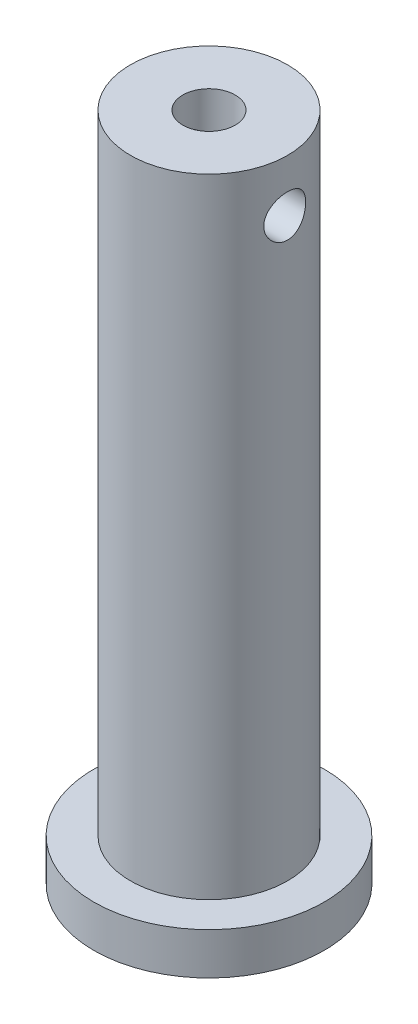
ISO-10303-21;
HEADER;
FILE_DESCRIPTION(('STEP AP214'),'2;1');
FILE_NAME('part.step','',(''),(''),'','','');
FILE_SCHEMA(('AUTOMOTIVE_DESIGN { 1 0 10303 214 1 1 1 1 }'));
ENDSEC;
DATA;
#1=APPLICATION_CONTEXT('core data for automotive mechanical design processes');
#2=APPLICATION_PROTOCOL_DEFINITION('international standard','automotive_design',2000,#1);
#3=PRODUCT_CONTEXT('',#1,'mechanical');
#4=PRODUCT('Part','Part','',(#3));
#5=PRODUCT_RELATED_PRODUCT_CATEGORY('part','',(#4));
#6=PRODUCT_DEFINITION_FORMATION('','',#4);
#7=PRODUCT_DEFINITION_CONTEXT('part definition',#1,'design');
#8=PRODUCT_DEFINITION('design','',#6,#7);
#9=PRODUCT_DEFINITION_SHAPE('','',#8);
#10=(LENGTH_UNIT() NAMED_UNIT(*) SI_UNIT(.MILLI.,.METRE.));
#11=(NAMED_UNIT(*) PLANE_ANGLE_UNIT() SI_UNIT($,.RADIAN.));
#12=(NAMED_UNIT(*) SI_UNIT($,.STERADIAN.) SOLID_ANGLE_UNIT());
#13=UNCERTAINTY_MEASURE_WITH_UNIT(LENGTH_MEASURE(1.E-05),#10,'distance_accuracy_value','');
#14=(GEOMETRIC_REPRESENTATION_CONTEXT(3) GLOBAL_UNCERTAINTY_ASSIGNED_CONTEXT((#13)) GLOBAL_UNIT_ASSIGNED_CONTEXT((#10,
#11,#12)) REPRESENTATION_CONTEXT('',''));
#15=CARTESIAN_POINT('',(0.,0.,0.));
#16=DIRECTION('',(0.,0.,1.));
#17=DIRECTION('',(1.,0.,0.));
#18=AXIS2_PLACEMENT_3D('',#15,#16,#17);
#19=CARTESIAN_POINT('',(0.,0.,0.));
#20=DIRECTION('',(0.,-1.,0.));
#21=DIRECTION('',(0.,0.,-1.));
#22=AXIS2_PLACEMENT_3D('',#19,#20,#21);
#23=PLANE('',#22);
#24=CARTESIAN_POINT('',(0.,0.,0.));
#25=DIRECTION('',(0.,-1.,0.));
#26=DIRECTION('',(0.,0.,-1.));
#27=AXIS2_PLACEMENT_3D('',#24,#25,#26);
#28=CIRCLE('',#27,5.5);
#29=CARTESIAN_POINT('',(0.,0.,-5.5));
#30=VERTEX_POINT('',#29);
#31=EDGE_CURVE('E11',#30,#30,#28,.T.);
#32=ORIENTED_EDGE('',*,*,#31,.T.);
#33=EDGE_LOOP('',(#32));
#34=FACE_BOUND('',#33,.T.);
#35=ADVANCED_FACE('F29',(#34),#23,.T.);
#36=CARTESIAN_POINT('',(0.,-9.92791878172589,0.));
#37=DIRECTION('',(0.,-1.,0.));
#38=DIRECTION('',(0.,0.,-1.));
#39=AXIS2_PLACEMENT_3D('',#36,#37,#38);
#40=CYLINDRICAL_SURFACE('',#39,5.5);
#41=CARTESIAN_POINT('',(0.,2.,0.));
#42=DIRECTION('',(0.,-1.,0.));
#43=DIRECTION('',(0.,0.,-1.));
#44=AXIS2_PLACEMENT_3D('',#41,#42,#43);
#45=CIRCLE('',#44,5.5);
#46=CARTESIAN_POINT('',(0.,2.,-5.5));
#47=VERTEX_POINT('',#46);
#48=EDGE_CURVE('E40',#47,#47,#45,.T.);
#49=ORIENTED_EDGE('',*,*,#48,.T.);
#50=EDGE_LOOP('',(#49));
#51=FACE_BOUND('',#50,.T.);
#52=ORIENTED_EDGE('',*,*,#31,.F.);
#53=EDGE_LOOP('',(#52));
#54=FACE_BOUND('',#53,.T.);
#55=ADVANCED_FACE('F98',(#51,#54),#40,.T.);
#56=CARTESIAN_POINT('',(5.5,2.,0.));
#57=DIRECTION('',(0.,1.,0.));
#58=DIRECTION('',(0.,0.,1.));
#59=AXIS2_PLACEMENT_3D('',#56,#57,#58);
#60=PLANE('',#59);
#61=CARTESIAN_POINT('',(0.,2.,0.));
#62=DIRECTION('',(0.,-1.,0.));
#63=DIRECTION('',(0.,0.,-1.));
#64=AXIS2_PLACEMENT_3D('',#61,#62,#63);
#65=CIRCLE('',#64,3.75);
#66=CARTESIAN_POINT('',(0.,2.,-3.75));
#67=VERTEX_POINT('',#66);
#68=EDGE_CURVE('E58',#67,#67,#65,.T.);
#69=ORIENTED_EDGE('',*,*,#68,.T.);
#70=EDGE_LOOP('',(#69));
#71=FACE_BOUND('',#70,.T.);
#72=ORIENTED_EDGE('',*,*,#48,.F.);
#73=EDGE_LOOP('',(#72));
#74=FACE_BOUND('',#73,.T.);
#75=ADVANCED_FACE('F94',(#71,#74),#60,.T.);
#76=CARTESIAN_POINT('',(0.,-9.92791878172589,0.));
#77=DIRECTION('',(0.,-1.,0.));
#78=DIRECTION('',(0.,0.,-1.));
#79=AXIS2_PLACEMENT_3D('',#76,#77,#78);
#80=CYLINDRICAL_SURFACE('',#79,3.75);
#81=CARTESIAN_POINT('',(-3.61420807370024,29.5,-1.));
#82=CARTESIAN_POINT('',(-3.61420902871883,29.4449120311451,-0.999998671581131));
#83=CARTESIAN_POINT('',(-3.61548132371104,29.389809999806,-0.995432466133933));
#84=CARTESIAN_POINT('',(-3.62041780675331,29.2811972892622,-0.977322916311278));
#85=CARTESIAN_POINT('',(-3.62408319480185,29.227687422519,-0.963775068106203));
#86=CARTESIAN_POINT('',(-3.63336187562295,29.1238459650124,-0.928179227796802));
#87=CARTESIAN_POINT('',(-3.63897242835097,29.073510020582,-0.906143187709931));
#88=CARTESIAN_POINT('',(-3.65150577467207,28.9772416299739,-0.854233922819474));
#89=CARTESIAN_POINT('',(-3.65842867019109,28.9313095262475,-0.824360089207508));
#90=CARTESIAN_POINT('',(-3.67300069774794,28.8440037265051,-0.756824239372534));
#91=CARTESIAN_POINT('',(-3.68066270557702,28.8027564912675,-0.719001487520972));
#92=CARTESIAN_POINT('',(-3.69573850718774,28.7271092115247,-0.636987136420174));
#93=CARTESIAN_POINT('',(-3.7031522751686,28.6927098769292,-0.592794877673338));
#94=CARTESIAN_POINT('',(-3.71703994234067,28.6312075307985,-0.498419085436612));
#95=CARTESIAN_POINT('',(-3.72349688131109,28.6042302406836,-0.448150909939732));
#96=CARTESIAN_POINT('',(-3.73459563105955,28.5591576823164,-0.34359152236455));
#97=CARTESIAN_POINT('',(-3.73923774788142,28.5410609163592,-0.289300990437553));
#98=CARTESIAN_POINT('',(-3.74609276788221,28.5146723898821,-0.179557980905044));
#99=CARTESIAN_POINT('',(-3.7483588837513,28.506165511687,-0.124160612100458));
#100=CARTESIAN_POINT('',(-3.75039262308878,28.4985214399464,-0.0126817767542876));
#101=CARTESIAN_POINT('',(-3.75016066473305,28.4993826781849,0.0433995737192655));
#102=CARTESIAN_POINT('',(-3.74726337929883,28.5102989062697,0.153157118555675));
#103=CARTESIAN_POINT('',(-3.74465957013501,28.5201214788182,0.206858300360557));
#104=CARTESIAN_POINT('',(-3.73738374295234,28.548306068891,0.311820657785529));
#105=CARTESIAN_POINT('',(-3.7327116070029,28.566668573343,0.363081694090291));
#106=CARTESIAN_POINT('',(-3.72173284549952,28.6115899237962,0.462301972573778));
#107=CARTESIAN_POINT('',(-3.71541043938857,28.6382284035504,0.510223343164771));
#108=CARTESIAN_POINT('',(-3.70181234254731,28.6988844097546,0.600994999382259));
#109=CARTESIAN_POINT('',(-3.69453646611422,28.7329033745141,0.643844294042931));
#110=CARTESIAN_POINT('',(-3.6795563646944,28.808588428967,0.724642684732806));
#111=CARTESIAN_POINT('',(-3.67184584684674,28.8504572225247,0.762400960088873));
#112=CARTESIAN_POINT('',(-3.65706702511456,28.9400123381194,0.830406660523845));
#113=CARTESIAN_POINT('',(-3.64999876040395,28.9876990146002,0.860653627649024));
#114=CARTESIAN_POINT('',(-3.63727951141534,29.0879500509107,0.912923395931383));
#115=CARTESIAN_POINT('',(-3.63163753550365,29.1405426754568,0.934894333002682));
#116=CARTESIAN_POINT('',(-3.62252162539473,29.2488632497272,0.969620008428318));
#117=CARTESIAN_POINT('',(-3.61904715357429,29.3045904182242,0.982377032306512));
#118=CARTESIAN_POINT('',(-3.61477417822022,29.4158136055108,0.997983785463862));
#119=CARTESIAN_POINT('',(-3.61389881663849,29.4712667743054,1.00111816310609));
#120=CARTESIAN_POINT('',(-3.61471289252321,29.5819048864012,0.998174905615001));
#121=CARTESIAN_POINT('',(-3.61640205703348,29.6370898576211,0.992098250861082));
#122=CARTESIAN_POINT('',(-3.62208062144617,29.7445282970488,0.971156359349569));
#123=CARTESIAN_POINT('',(-3.62602519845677,29.7968177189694,0.956462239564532));
#124=CARTESIAN_POINT('',(-3.63572634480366,29.8981898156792,0.918894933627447));
#125=CARTESIAN_POINT('',(-3.64148315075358,29.9472720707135,0.896020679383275));
#126=CARTESIAN_POINT('',(-3.65431786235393,30.0420274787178,0.842164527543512));
#127=CARTESIAN_POINT('',(-3.66142202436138,30.0876019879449,0.811015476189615));
#128=CARTESIAN_POINT('',(-3.67608920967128,30.1729816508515,0.741701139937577));
#129=CARTESIAN_POINT('',(-3.68365231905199,30.2127857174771,0.703534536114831));
#130=CARTESIAN_POINT('',(-3.69864982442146,30.286676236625,0.619951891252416));
#131=CARTESIAN_POINT('',(-3.70607418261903,30.3205641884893,0.574358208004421));
#132=CARTESIAN_POINT('',(-3.71973335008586,30.3802054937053,0.477964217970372));
#133=CARTESIAN_POINT('',(-3.72596822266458,30.4059592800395,0.427164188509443));
#134=CARTESIAN_POINT('',(-3.73650575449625,30.4483648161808,0.322157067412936));
#135=CARTESIAN_POINT('',(-3.74082279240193,30.4650845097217,0.267978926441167));
#136=CARTESIAN_POINT('',(-3.74710151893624,30.4891443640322,0.157449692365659));
#137=CARTESIAN_POINT('',(-3.74906372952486,30.4964866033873,0.101099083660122));
#138=CARTESIAN_POINT('',(-3.75038706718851,30.5014529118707,-0.010321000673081));
#139=CARTESIAN_POINT('',(-3.74982613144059,30.4993681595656,-0.0653767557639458));
#140=CARTESIAN_POINT('',(-3.74634245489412,30.4862157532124,-0.174324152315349));
#141=CARTESIAN_POINT('',(-3.74341980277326,30.4751484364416,-0.228215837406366));
#142=CARTESIAN_POINT('',(-3.73555655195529,30.4445096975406,-0.332955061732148));
#143=CARTESIAN_POINT('',(-3.73062998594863,30.4249973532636,-0.383821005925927));
#144=CARTESIAN_POINT('',(-3.71927408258,30.3780751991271,-0.481586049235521));
#145=CARTESIAN_POINT('',(-3.71284453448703,30.3506642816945,-0.528484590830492));
#146=CARTESIAN_POINT('',(-3.6989566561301,30.2878708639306,-0.618339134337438));
#147=CARTESIAN_POINT('',(-3.69147546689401,30.2522953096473,-0.661156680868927));
#148=CARTESIAN_POINT('',(-3.67642000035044,30.1745486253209,-0.740312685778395));
#149=CARTESIAN_POINT('',(-3.66884569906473,30.132375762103,-0.776649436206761));
#150=CARTESIAN_POINT('',(-3.65426979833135,30.0415158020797,-0.842603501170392));
#151=CARTESIAN_POINT('',(-3.64728445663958,29.9927058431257,-0.872055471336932));
#152=CARTESIAN_POINT('',(-3.63490697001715,29.8906468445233,-0.922293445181));
#153=CARTESIAN_POINT('',(-3.62951378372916,29.837400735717,-0.943085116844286));
#154=CARTESIAN_POINT('',(-3.62168000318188,29.7369593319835,-0.972690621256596));
#155=CARTESIAN_POINT('',(-3.61890070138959,29.6901993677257,-0.982907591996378));
#156=CARTESIAN_POINT('',(-3.61516442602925,29.595629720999,-0.996562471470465));
#157=CARTESIAN_POINT('',(-3.6142072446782,29.5478201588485,-1.00000115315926));
#158=CARTESIAN_POINT('',(-3.61420807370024,29.5,-1.));
#159=B_SPLINE_CURVE_WITH_KNOTS('',3,(#81,#82,#83,#84,#85,#86,#87,#88,#89,#90,#91,#92,#93,#94,
#95,#96,#97,#98,#99,#100,#101,#102,#103,#104,#105,#106,#107,#108,#109,#110,#111,#112,#113,#114,
#115,#116,#117,#118,#119,#120,#121,#122,#123,#124,#125,#126,#127,#128,#129,#130,#131,#132,#133,
#134,#135,#136,#137,#138,#139,#140,#141,#142,#143,#144,#145,#146,#147,#148,#149,#150,#151,#152,
#153,#154,#155,#156,#157,#158),.UNSPECIFIED.,.T.,.F.,(4,2,2,2,2,2,2,2,2,2,2,2,2,2,2,2,2,2,2,2,2,
2,2,2,2,2,2,2,2,2,2,2,2,2,2,2,2,2,4),(0.,0.165088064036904,0.330258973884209,0.495198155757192,
0.660150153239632,0.828829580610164,0.997526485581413,1.16892603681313,1.34029667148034,
1.50774152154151,1.67515834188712,1.83835285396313,2.00155667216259,2.16638224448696,
2.33123996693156,2.50115881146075,2.671088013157,2.84206507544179,3.01299971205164,
3.17882667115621,3.34463598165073,3.50725925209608,3.66990376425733,3.83612317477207,
4.00237385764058,4.17342953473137,4.34447610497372,4.51421769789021,4.68392165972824,
4.84842027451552,5.01291271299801,5.17627257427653,5.33965535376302,5.50739426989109,
5.67517732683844,5.84665019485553,6.01801066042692,6.16133483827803,6.30464267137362),.UNSPECIFIED.);
#160=CARTESIAN_POINT('',(-3.61420807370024,29.5,-1.));
#161=VERTEX_POINT('',#160);
#162=EDGE_CURVE('E61',#161,#161,#159,.T.);
#163=ORIENTED_EDGE('',*,*,#162,.F.);
#164=EDGE_LOOP('',(#163));
#165=FACE_BOUND('',#164,.T.);
#166=CARTESIAN_POINT('',(3.61420807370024,29.5,-1.));
#167=CARTESIAN_POINT('',(3.61420902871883,29.5550879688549,-0.999998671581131));
#168=CARTESIAN_POINT('',(3.61548132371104,29.610190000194,-0.995432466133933));
#169=CARTESIAN_POINT('',(3.62041780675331,29.7188027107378,-0.977322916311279));
#170=CARTESIAN_POINT('',(3.62408319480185,29.772312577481,-0.963775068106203));
#171=CARTESIAN_POINT('',(3.63336187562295,29.8761540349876,-0.928179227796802));
#172=CARTESIAN_POINT('',(3.63897242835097,29.926489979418,-0.906143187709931));
#173=CARTESIAN_POINT('',(3.65150577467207,30.0227583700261,-0.854233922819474));
#174=CARTESIAN_POINT('',(3.65842867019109,30.0686904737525,-0.824360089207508));
#175=CARTESIAN_POINT('',(3.67300069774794,30.1559962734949,-0.756824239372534));
#176=CARTESIAN_POINT('',(3.68066270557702,30.1972435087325,-0.719001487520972));
#177=CARTESIAN_POINT('',(3.69573850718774,30.2728907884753,-0.636987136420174));
#178=CARTESIAN_POINT('',(3.7031522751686,30.3072901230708,-0.592794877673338));
#179=CARTESIAN_POINT('',(3.71703994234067,30.3687924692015,-0.498419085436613));
#180=CARTESIAN_POINT('',(3.72349688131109,30.3957697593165,-0.448150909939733));
#181=CARTESIAN_POINT('',(3.73459563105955,30.4408423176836,-0.343591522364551));
#182=CARTESIAN_POINT('',(3.73923774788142,30.4589390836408,-0.289300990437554));
#183=CARTESIAN_POINT('',(3.74609276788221,30.4853276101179,-0.179557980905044));
#184=CARTESIAN_POINT('',(3.7483588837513,30.493834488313,-0.124160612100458));
#185=CARTESIAN_POINT('',(3.75039262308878,30.5014785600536,-0.0126817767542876));
#186=CARTESIAN_POINT('',(3.75016066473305,30.5006173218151,0.0433995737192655));
#187=CARTESIAN_POINT('',(3.74726337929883,30.4897010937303,0.153157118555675));
#188=CARTESIAN_POINT('',(3.74465957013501,30.4798785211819,0.206858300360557));
#189=CARTESIAN_POINT('',(3.73738374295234,30.451693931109,0.311820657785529));
#190=CARTESIAN_POINT('',(3.7327116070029,30.433331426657,0.363081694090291));
#191=CARTESIAN_POINT('',(3.72173284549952,30.3884100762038,0.462301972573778));
#192=CARTESIAN_POINT('',(3.71541043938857,30.3617715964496,0.510223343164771));
#193=CARTESIAN_POINT('',(3.70181234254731,30.3011155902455,0.600994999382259));
#194=CARTESIAN_POINT('',(3.69453646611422,30.2670966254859,0.643844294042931));
#195=CARTESIAN_POINT('',(3.6795563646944,30.191411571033,0.724642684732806));
#196=CARTESIAN_POINT('',(3.67184584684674,30.1495427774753,0.762400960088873));
#197=CARTESIAN_POINT('',(3.65706702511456,30.0599876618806,0.830406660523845));
#198=CARTESIAN_POINT('',(3.64999876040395,30.0123009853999,0.860653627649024));
#199=CARTESIAN_POINT('',(3.63727951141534,29.9120499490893,0.912923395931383));
#200=CARTESIAN_POINT('',(3.63163753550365,29.8594573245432,0.934894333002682));
#201=CARTESIAN_POINT('',(3.62252162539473,29.7511367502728,0.969620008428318));
#202=CARTESIAN_POINT('',(3.61904715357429,29.6954095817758,0.982377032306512));
#203=CARTESIAN_POINT('',(3.61477417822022,29.5841863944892,0.997983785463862));
#204=CARTESIAN_POINT('',(3.61389881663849,29.5287332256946,1.00111816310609));
#205=CARTESIAN_POINT('',(3.61471289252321,29.4180951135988,0.998174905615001));
#206=CARTESIAN_POINT('',(3.61640205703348,29.3629101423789,0.992098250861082));
#207=CARTESIAN_POINT('',(3.62208062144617,29.2554717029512,0.971156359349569));
#208=CARTESIAN_POINT('',(3.62602519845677,29.2031822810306,0.956462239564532));
#209=CARTESIAN_POINT('',(3.63572634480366,29.1018101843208,0.918894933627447));
#210=CARTESIAN_POINT('',(3.64148315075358,29.0527279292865,0.896020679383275));
#211=CARTESIAN_POINT('',(3.65431786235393,28.9579725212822,0.842164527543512));
#212=CARTESIAN_POINT('',(3.66142202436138,28.9123980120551,0.811015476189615));
#213=CARTESIAN_POINT('',(3.67608920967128,28.8270183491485,0.741701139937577));
#214=CARTESIAN_POINT('',(3.68365231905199,28.7872142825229,0.703534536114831));
#215=CARTESIAN_POINT('',(3.69864982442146,28.713323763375,0.619951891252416));
#216=CARTESIAN_POINT('',(3.70607418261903,28.6794358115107,0.574358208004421));
#217=CARTESIAN_POINT('',(3.71973335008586,28.6197945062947,0.477964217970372));
#218=CARTESIAN_POINT('',(3.72596822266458,28.5940407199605,0.427164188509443));
#219=CARTESIAN_POINT('',(3.73650575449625,28.5516351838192,0.322157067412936));
#220=CARTESIAN_POINT('',(3.74082279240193,28.5349154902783,0.267978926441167));
#221=CARTESIAN_POINT('',(3.74710151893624,28.5108556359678,0.157449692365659));
#222=CARTESIAN_POINT('',(3.74906372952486,28.5035133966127,0.101099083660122));
#223=CARTESIAN_POINT('',(3.75038706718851,28.4985470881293,-0.010321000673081));
#224=CARTESIAN_POINT('',(3.74982613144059,28.5006318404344,-0.0653767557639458));
#225=CARTESIAN_POINT('',(3.74634245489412,28.5137842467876,-0.174324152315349));
#226=CARTESIAN_POINT('',(3.74341980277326,28.5248515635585,-0.228215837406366));
#227=CARTESIAN_POINT('',(3.73555655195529,28.5554903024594,-0.332955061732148));
#228=CARTESIAN_POINT('',(3.73062998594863,28.5750026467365,-0.383821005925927));
#229=CARTESIAN_POINT('',(3.71927408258,28.6219248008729,-0.481586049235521));
#230=CARTESIAN_POINT('',(3.71284453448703,28.6493357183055,-0.528484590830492));
#231=CARTESIAN_POINT('',(3.6989566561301,28.7121291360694,-0.618339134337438));
#232=CARTESIAN_POINT('',(3.69147546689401,28.7477046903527,-0.661156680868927));
#233=CARTESIAN_POINT('',(3.67642000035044,28.8254513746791,-0.740312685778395));
#234=CARTESIAN_POINT('',(3.66884569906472,28.867624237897,-0.776649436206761));
#235=CARTESIAN_POINT('',(3.65426979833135,28.9584841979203,-0.842603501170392));
#236=CARTESIAN_POINT('',(3.64728445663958,29.0072941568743,-0.872055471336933));
#237=CARTESIAN_POINT('',(3.63490697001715,29.1093531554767,-0.922293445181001));
#238=CARTESIAN_POINT('',(3.62951378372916,29.162599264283,-0.943085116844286));
#239=CARTESIAN_POINT('',(3.62168000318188,29.2630406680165,-0.972690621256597));
#240=CARTESIAN_POINT('',(3.61890070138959,29.3098006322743,-0.98290759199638));
#241=CARTESIAN_POINT('',(3.61516442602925,29.4043702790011,-0.996562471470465));
#242=CARTESIAN_POINT('',(3.6142072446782,29.4521798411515,-1.00000115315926));
#243=CARTESIAN_POINT('',(3.61420807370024,29.5,-1.));
#244=B_SPLINE_CURVE_WITH_KNOTS('',3,(#166,#167,#168,#169,#170,#171,#172,#173,#174,#175,#176,
#177,#178,#179,#180,#181,#182,#183,#184,#185,#186,#187,#188,#189,#190,#191,#192,#193,#194,#195,
#196,#197,#198,#199,#200,#201,#202,#203,#204,#205,#206,#207,#208,#209,#210,#211,#212,#213,#214,
#215,#216,#217,#218,#219,#220,#221,#222,#223,#224,#225,#226,#227,#228,#229,#230,#231,#232,#233,
#234,#235,#236,#237,#238,#239,#240,#241,#242,#243),.UNSPECIFIED.,.T.,.F.,(4,2,2,2,2,2,2,2,2,2,2,
2,2,2,2,2,2,2,2,2,2,2,2,2,2,2,2,2,2,2,2,2,2,2,2,2,2,2,4),(0.,0.165088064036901,
0.330258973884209,0.495198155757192,0.660150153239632,0.828829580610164,0.997526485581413,
1.16892603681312,1.34029667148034,1.50774152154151,1.67515834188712,1.83835285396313,
2.00155667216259,2.16638224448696,2.33123996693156,2.50115881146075,2.671088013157,
2.84206507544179,3.01299971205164,3.17882667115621,3.34463598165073,3.50725925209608,
3.66990376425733,3.83612317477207,4.00237385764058,4.17342953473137,4.34447610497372,
4.51421769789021,4.68392165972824,4.84842027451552,5.01291271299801,5.17627257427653,
5.33965535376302,5.50739426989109,5.67517732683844,5.84665019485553,6.01801066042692,
6.16133483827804,6.30464267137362),.UNSPECIFIED.);
#245=CARTESIAN_POINT('',(3.61420807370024,29.5,-1.));
#246=VERTEX_POINT('',#245);
#247=EDGE_CURVE('E82',#246,#246,#244,.T.);
#248=ORIENTED_EDGE('',*,*,#247,.F.);
#249=EDGE_LOOP('',(#248));
#250=FACE_BOUND('',#249,.T.);
#251=CARTESIAN_POINT('',(0.,32.,0.));
#252=DIRECTION('',(0.,-1.,0.));
#253=DIRECTION('',(0.,0.,-1.));
#254=AXIS2_PLACEMENT_3D('',#251,#252,#253);
#255=CIRCLE('',#254,3.75);
#256=CARTESIAN_POINT('',(0.,32.,-3.75));
#257=VERTEX_POINT('',#256);
#258=EDGE_CURVE('E54',#257,#257,#255,.T.);
#259=ORIENTED_EDGE('',*,*,#258,.T.);
#260=EDGE_LOOP('',(#259));
#261=FACE_BOUND('',#260,.T.);
#262=ORIENTED_EDGE('',*,*,#68,.F.);
#263=EDGE_LOOP('',(#262));
#264=FACE_BOUND('',#263,.T.);
#265=ADVANCED_FACE('F89',(#165,#250,#261,#264),#80,.T.);
#266=CARTESIAN_POINT('',(3.75,32.,0.));
#267=DIRECTION('',(0.,1.,0.));
#268=DIRECTION('',(0.,0.,1.));
#269=AXIS2_PLACEMENT_3D('',#266,#267,#268);
#270=PLANE('',#269);
#271=CARTESIAN_POINT('',(0.,32.,0.));
#272=DIRECTION('',(0.,1.,0.));
#273=DIRECTION('',(0.,0.,1.));
#274=AXIS2_PLACEMENT_3D('',#271,#272,#273);
#275=CIRCLE('',#274,1.25);
#276=CARTESIAN_POINT('',(0.,32.,1.25));
#277=VERTEX_POINT('',#276);
#278=EDGE_CURVE('E55',#277,#277,#275,.T.);
#279=ORIENTED_EDGE('',*,*,#278,.F.);
#280=EDGE_LOOP('',(#279));
#281=FACE_BOUND('',#280,.T.);
#282=ORIENTED_EDGE('',*,*,#258,.F.);
#283=EDGE_LOOP('',(#282));
#284=FACE_BOUND('',#283,.T.);
#285=ADVANCED_FACE('F48',(#281,#284),#270,.T.);
#286=CARTESIAN_POINT('',(0.,14.5,0.));
#287=DIRECTION('',(0.,1.,0.));
#288=DIRECTION('',(0.,0.,1.));
#289=AXIS2_PLACEMENT_3D('',#286,#287,#288);
#290=CONICAL_SURFACE('',#289,1.25,1.02974425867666);
#291=CARTESIAN_POINT('',(0.,13.7489242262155,0.));
#292=VERTEX_POINT('',#291);
#293=VERTEX_LOOP('',#292);
#294=FACE_BOUND('',#293,.T.);
#295=CARTESIAN_POINT('',(0.,14.5,0.));
#296=DIRECTION('',(0.,1.,0.));
#297=DIRECTION('',(0.,0.,1.));
#298=AXIS2_PLACEMENT_3D('',#295,#296,#297);
#299=CIRCLE('',#298,1.25);
#300=CARTESIAN_POINT('',(0.,14.5,1.25));
#301=VERTEX_POINT('',#300);
#302=EDGE_CURVE('E52',#301,#301,#299,.T.);
#303=ORIENTED_EDGE('',*,*,#302,.T.);
#304=EDGE_LOOP('',(#303));
#305=FACE_BOUND('',#304,.T.);
#306=ADVANCED_FACE('F44',(#294,#305),#290,.F.);
#307=CARTESIAN_POINT('',(0.,32.,0.));
#308=DIRECTION('',(0.,1.,0.));
#309=DIRECTION('',(0.,0.,1.));
#310=AXIS2_PLACEMENT_3D('',#307,#308,#309);
#311=CYLINDRICAL_SURFACE('',#310,1.25);
#312=CARTESIAN_POINT('',(-0.749999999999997,29.5,-1.));
#313=CARTESIAN_POINT('',(-0.750011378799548,29.4624594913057,-0.9999949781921));
#314=CARTESIAN_POINT('',(-0.752877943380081,29.4248605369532,-0.997861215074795));
#315=CARTESIAN_POINT('',(-0.763798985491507,29.3508427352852,-0.989521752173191));
#316=CARTESIAN_POINT('',(-0.771871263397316,29.3144283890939,-0.983302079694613));
#317=CARTESIAN_POINT('',(-0.795391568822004,29.2311972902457,-0.964441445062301));
#318=CARTESIAN_POINT('',(-0.81242974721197,29.1851787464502,-0.95031793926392));
#319=CARTESIAN_POINT('',(-0.85047266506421,29.0970159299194,-0.916432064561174));
#320=CARTESIAN_POINT('',(-0.871488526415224,29.0548830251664,-0.896653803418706));
#321=CARTESIAN_POINT('',(-0.923124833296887,28.9598301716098,-0.843888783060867));
#322=CARTESIAN_POINT('',(-0.954470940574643,28.9085167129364,-0.808711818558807));
#323=CARTESIAN_POINT('',(-1.01643998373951,28.8130115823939,-0.729309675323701));
#324=CARTESIAN_POINT('',(-1.04706349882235,28.7688140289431,-0.685092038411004));
#325=CARTESIAN_POINT('',(-1.09895337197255,28.6964475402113,-0.597380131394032));
#326=CARTESIAN_POINT('',(-1.12087340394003,28.666836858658,-0.555466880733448));
#327=CARTESIAN_POINT('',(-1.16082576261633,28.6138170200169,-0.466222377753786));
#328=CARTESIAN_POINT('',(-1.17886412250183,28.5903982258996,-0.41889971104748));
#329=CARTESIAN_POINT('',(-1.20707822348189,28.5541435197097,-0.327658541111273));
#330=CARTESIAN_POINT('',(-1.21805368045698,28.5402087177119,-0.284426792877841));
#331=CARTESIAN_POINT('',(-1.23542956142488,28.518250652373,-0.195594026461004));
#332=CARTESIAN_POINT('',(-1.24183248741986,28.510224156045,-0.14999431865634));
#333=CARTESIAN_POINT('',(-1.24953984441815,28.500570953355,-0.0575241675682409));
#334=CARTESIAN_POINT('',(-1.25082662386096,28.4989664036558,-0.0106498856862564));
#335=CARTESIAN_POINT('',(-1.24813468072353,28.502332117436,0.0827081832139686));
#336=CARTESIAN_POINT('',(-1.24415571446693,28.507302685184,0.129191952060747));
#337=CARTESIAN_POINT('',(-1.2316418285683,28.5230339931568,0.217841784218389));
#338=CARTESIAN_POINT('',(-1.22336702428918,28.5334644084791,0.26010509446));
#339=CARTESIAN_POINT('',(-1.20302246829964,28.5593476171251,0.342085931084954));
#340=CARTESIAN_POINT('',(-1.19095175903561,28.574801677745,0.381802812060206));
#341=CARTESIAN_POINT('',(-1.16243110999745,28.6118003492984,0.461763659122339));
#342=CARTESIAN_POINT('',(-1.1456713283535,28.6337882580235,0.501689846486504));
#343=CARTESIAN_POINT('',(-1.10947021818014,28.6822689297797,0.577354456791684));
#344=CARTESIAN_POINT('',(-1.09002738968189,28.7087642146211,0.613090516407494));
#345=CARTESIAN_POINT('',(-1.04526755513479,28.7715309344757,0.687132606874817));
#346=CARTESIAN_POINT('',(-1.019565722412,28.8086918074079,0.724450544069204));
#347=CARTESIAN_POINT('',(-0.9674618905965,28.8881279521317,0.792691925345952));
#348=CARTESIAN_POINT('',(-0.941059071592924,28.9304094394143,0.823607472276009));
#349=CARTESIAN_POINT('',(-0.892206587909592,29.0156100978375,0.876142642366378));
#350=CARTESIAN_POINT('',(-0.869621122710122,29.058075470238,0.898370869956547));
#351=CARTESIAN_POINT('',(-0.827910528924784,29.1471832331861,0.936945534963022));
#352=CARTESIAN_POINT('',(-0.808777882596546,29.193816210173,0.953304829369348));
#353=CARTESIAN_POINT('',(-0.781969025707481,29.2763958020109,0.975310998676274));
#354=CARTESIAN_POINT('',(-0.772578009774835,29.3113064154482,0.982701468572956));
#355=CARTESIAN_POINT('',(-0.758336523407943,29.3825901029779,0.993734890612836));
#356=CARTESIAN_POINT('',(-0.75347593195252,29.4189597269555,0.997386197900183));
#357=CARTESIAN_POINT('',(-0.749138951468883,29.4924316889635,1.00064997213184));
#358=CARTESIAN_POINT('',(-0.749693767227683,29.5295370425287,1.00023903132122));
#359=CARTESIAN_POINT('',(-0.756152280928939,29.6030236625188,0.995363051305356));
#360=CARTESIAN_POINT('',(-0.762063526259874,29.6394038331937,0.990892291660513));
#361=CARTESIAN_POINT('',(-0.780257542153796,29.7195316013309,0.976657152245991));
#362=CARTESIAN_POINT('',(-0.793778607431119,29.7627991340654,0.965835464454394));
#363=CARTESIAN_POINT('',(-0.825114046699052,29.8461454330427,0.939206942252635));
#364=CARTESIAN_POINT('',(-0.84294118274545,29.8862142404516,0.923385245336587));
#365=CARTESIAN_POINT('',(-0.88951624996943,29.9807644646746,0.87903804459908));
#366=CARTESIAN_POINT('',(-0.91952782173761,30.0334476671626,0.848012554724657));
#367=CARTESIAN_POINT('',(-0.980134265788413,30.132192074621,0.777190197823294));
#368=CARTESIAN_POINT('',(-1.01072978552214,30.1782453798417,0.737383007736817));
#369=CARTESIAN_POINT('',(-1.06996649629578,30.2637314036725,0.648511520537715));
#370=CARTESIAN_POINT('',(-1.0985739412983,30.3030613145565,0.599324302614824));
#371=CARTESIAN_POINT('',(-1.15041523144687,30.3726332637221,0.492485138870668));
#372=CARTESIAN_POINT('',(-1.1736664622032,30.4029048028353,0.434861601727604));
#373=CARTESIAN_POINT('',(-1.20581580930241,30.4442452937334,0.332265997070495));
#374=CARTESIAN_POINT('',(-1.21692460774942,30.4583586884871,0.289204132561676));
#375=CARTESIAN_POINT('',(-1.23460775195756,30.480716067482,0.200682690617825));
#376=CARTESIAN_POINT('',(-1.24118555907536,30.4889645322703,0.15522497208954));
#377=CARTESIAN_POINT('',(-1.24927349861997,30.4990964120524,0.0629806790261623));
#378=CARTESIAN_POINT('',(-1.2507651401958,30.5009566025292,0.016189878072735));
#379=CARTESIAN_POINT('',(-1.2484935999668,30.4981167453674,-0.0770647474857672));
#380=CARTESIAN_POINT('',(-1.24473004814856,30.4934162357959,-0.123528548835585));
#381=CARTESIAN_POINT('',(-1.23262004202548,30.4781982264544,-0.212242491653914));
#382=CARTESIAN_POINT('',(-1.2245295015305,30.4680053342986,-0.254585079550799));
#383=CARTESIAN_POINT('',(-1.20452600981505,30.4425732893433,-0.336760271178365));
#384=CARTESIAN_POINT('',(-1.19261206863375,30.427332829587,-0.376592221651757));
#385=CARTESIAN_POINT('',(-1.16443101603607,30.3908127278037,-0.456691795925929));
#386=CARTESIAN_POINT('',(-1.14786198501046,30.3691030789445,-0.49665504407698));
#387=CARTESIAN_POINT('',(-1.11201698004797,30.3211788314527,-0.57243198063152));
#388=CARTESIAN_POINT('',(-1.09273956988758,30.2949618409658,-0.608243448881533));
#389=CARTESIAN_POINT('',(-1.04833426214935,30.2328518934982,-0.68244111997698));
#390=CARTESIAN_POINT('',(-1.02281649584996,30.1960767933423,-0.719854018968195));
#391=CARTESIAN_POINT('',(-0.971006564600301,30.1174415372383,-0.788346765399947));
#392=CARTESIAN_POINT('',(-0.944713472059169,30.0755750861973,-0.819418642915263));
#393=CARTESIAN_POINT('',(-0.895545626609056,29.9905212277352,-0.872756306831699));
#394=CARTESIAN_POINT('',(-0.872566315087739,29.947713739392,-0.895530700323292));
#395=CARTESIAN_POINT('',(-0.830037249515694,29.8578040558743,-0.935081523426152));
#396=CARTESIAN_POINT('',(-0.810481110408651,29.8107101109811,-0.951869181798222));
#397=CARTESIAN_POINT('',(-0.782900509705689,29.7269303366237,-0.97457069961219));
#398=CARTESIAN_POINT('',(-0.773176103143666,29.6912902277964,-0.982232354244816));
#399=CARTESIAN_POINT('',(-0.758477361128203,29.6184878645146,-0.993631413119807));
#400=CARTESIAN_POINT('',(-0.753484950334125,29.581331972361,-0.997383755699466));
#401=CARTESIAN_POINT('',(-0.750427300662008,29.5293373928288,-0.999678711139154));
#402=CARTESIAN_POINT('',(-0.749995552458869,29.5146731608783,-1.00000196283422));
#403=CARTESIAN_POINT('',(-0.749999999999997,29.5,-1.));
#404=B_SPLINE_CURVE_WITH_KNOTS('',3,(#312,#313,#314,#315,#316,#317,#318,#319,#320,#321,#322,
#323,#324,#325,#326,#327,#328,#329,#330,#331,#332,#333,#334,#335,#336,#337,#338,#339,#340,#341,
#342,#343,#344,#345,#346,#347,#348,#349,#350,#351,#352,#353,#354,#355,#356,#357,#358,#359,#360,
#361,#362,#363,#364,#365,#366,#367,#368,#369,#370,#371,#372,#373,#374,#375,#376,#377,#378,#379,
#380,#381,#382,#383,#384,#385,#386,#387,#388,#389,#390,#391,#392,#393,#394,#395,#396,#397,#398,
#399,#400,#401,#402,#403),.UNSPECIFIED.,.T.,.F.,(4,2,2,2,2,2,2,2,2,2,2,2,2,2,2,2,2,2,2,2,2,2,2,
2,2,2,2,2,2,2,2,2,2,2,2,2,2,2,2,2,2,2,2,2,2,4),(0.,0.112570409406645,0.225527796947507,
0.377857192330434,0.530618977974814,0.738604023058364,0.946416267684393,1.11319651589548,
1.27971563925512,1.41931047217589,1.55882886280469,1.69882819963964,1.83883401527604,
1.97120958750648,2.10361857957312,2.24878255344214,2.39402801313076,2.56920613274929,
2.74459905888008,2.90309596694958,3.06124350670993,3.17153863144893,3.28158676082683,
3.39226938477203,3.50310820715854,3.64214280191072,3.78159462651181,3.98487905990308,
4.1884037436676,4.39480587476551,4.60052830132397,4.7399296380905,4.87922436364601,
5.01902496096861,5.15883540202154,5.29116720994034,5.42353330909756,5.56821679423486,
5.71297729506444,5.88736759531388,6.06197575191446,6.22247870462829,6.38267901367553,
6.49545691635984,6.60780227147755,6.65180177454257),.UNSPECIFIED.);
#405=CARTESIAN_POINT('',(-0.749999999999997,29.5,-1.));
#406=VERTEX_POINT('',#405);
#407=EDGE_CURVE('E32',#406,#406,#404,.T.);
#408=ORIENTED_EDGE('',*,*,#407,.T.);
#409=EDGE_LOOP('',(#408));
#410=FACE_BOUND('',#409,.T.);
#411=CARTESIAN_POINT('',(0.749999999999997,29.5,-1.));
#412=CARTESIAN_POINT('',(0.750011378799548,29.5375405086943,-0.9999949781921));
#413=CARTESIAN_POINT('',(0.752877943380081,29.5751394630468,-0.997861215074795));
#414=CARTESIAN_POINT('',(0.763798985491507,29.6491572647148,-0.989521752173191));
#415=CARTESIAN_POINT('',(0.771871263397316,29.6855716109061,-0.983302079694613));
#416=CARTESIAN_POINT('',(0.795391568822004,29.7688027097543,-0.964441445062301));
#417=CARTESIAN_POINT('',(0.81242974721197,29.8148212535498,-0.95031793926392));
#418=CARTESIAN_POINT('',(0.85047266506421,29.9029840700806,-0.916432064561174));
#419=CARTESIAN_POINT('',(0.871488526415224,29.9451169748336,-0.896653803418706));
#420=CARTESIAN_POINT('',(0.923124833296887,30.0401698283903,-0.843888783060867));
#421=CARTESIAN_POINT('',(0.954470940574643,30.0914832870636,-0.808711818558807));
#422=CARTESIAN_POINT('',(1.01643998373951,30.1869884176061,-0.729309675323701));
#423=CARTESIAN_POINT('',(1.04706349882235,30.2311859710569,-0.685092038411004));
#424=CARTESIAN_POINT('',(1.09895337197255,30.3035524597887,-0.597380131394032));
#425=CARTESIAN_POINT('',(1.12087340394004,30.333163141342,-0.555466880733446));
#426=CARTESIAN_POINT('',(1.16082576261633,30.3861829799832,-0.466222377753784));
#427=CARTESIAN_POINT('',(1.17886412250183,30.4096017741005,-0.418899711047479));
#428=CARTESIAN_POINT('',(1.20707822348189,30.4458564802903,-0.327658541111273));
#429=CARTESIAN_POINT('',(1.21805368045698,30.4597912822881,-0.284426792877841));
#430=CARTESIAN_POINT('',(1.23542956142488,30.481749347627,-0.195594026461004));
#431=CARTESIAN_POINT('',(1.24183248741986,30.4897758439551,-0.14999431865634));
#432=CARTESIAN_POINT('',(1.24953984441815,30.4994290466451,-0.0575241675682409));
#433=CARTESIAN_POINT('',(1.25082662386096,30.5010335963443,-0.0106498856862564));
#434=CARTESIAN_POINT('',(1.24813468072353,30.497667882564,0.0827081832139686));
#435=CARTESIAN_POINT('',(1.24415571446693,30.492697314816,0.129191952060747));
#436=CARTESIAN_POINT('',(1.2316418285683,30.4769660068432,0.217841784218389));
#437=CARTESIAN_POINT('',(1.22336702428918,30.466535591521,0.26010509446));
#438=CARTESIAN_POINT('',(1.20302246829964,30.4406523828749,0.342085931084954));
#439=CARTESIAN_POINT('',(1.19095175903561,30.425198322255,0.381802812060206));
#440=CARTESIAN_POINT('',(1.16243110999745,30.3881996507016,0.46176365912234));
#441=CARTESIAN_POINT('',(1.1456713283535,30.3662117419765,0.501689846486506));
#442=CARTESIAN_POINT('',(1.10947021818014,30.3177310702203,0.577354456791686));
#443=CARTESIAN_POINT('',(1.09002738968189,30.2912357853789,0.613090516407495));
#444=CARTESIAN_POINT('',(1.04526755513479,30.2284690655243,0.687132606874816));
#445=CARTESIAN_POINT('',(1.019565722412,30.1913081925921,0.724450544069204));
#446=CARTESIAN_POINT('',(0.9674618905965,30.1118720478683,0.792691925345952));
#447=CARTESIAN_POINT('',(0.941059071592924,30.0695905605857,0.823607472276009));
#448=CARTESIAN_POINT('',(0.892206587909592,29.9843899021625,0.876142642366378));
#449=CARTESIAN_POINT('',(0.869621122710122,29.9419245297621,0.898370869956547));
#450=CARTESIAN_POINT('',(0.827910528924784,29.8528167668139,0.936945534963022));
#451=CARTESIAN_POINT('',(0.808777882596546,29.806183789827,0.953304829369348));
#452=CARTESIAN_POINT('',(0.781969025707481,29.7236041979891,0.975310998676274));
#453=CARTESIAN_POINT('',(0.772578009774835,29.6886935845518,0.982701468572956));
#454=CARTESIAN_POINT('',(0.758336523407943,29.6174098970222,0.993734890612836));
#455=CARTESIAN_POINT('',(0.75347593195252,29.5810402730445,0.997386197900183));
#456=CARTESIAN_POINT('',(0.749138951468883,29.5075683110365,1.00064997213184));
#457=CARTESIAN_POINT('',(0.749693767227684,29.4704629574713,1.00023903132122));
#458=CARTESIAN_POINT('',(0.756152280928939,29.3969763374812,0.995363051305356));
#459=CARTESIAN_POINT('',(0.762063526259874,29.3605961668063,0.990892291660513));
#460=CARTESIAN_POINT('',(0.780257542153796,29.2804683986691,0.976657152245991));
#461=CARTESIAN_POINT('',(0.793778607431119,29.2372008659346,0.965835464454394));
#462=CARTESIAN_POINT('',(0.825114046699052,29.1538545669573,0.939206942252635));
#463=CARTESIAN_POINT('',(0.84294118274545,29.1137857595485,0.923385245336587));
#464=CARTESIAN_POINT('',(0.889516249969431,29.0192355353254,0.87903804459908));
#465=CARTESIAN_POINT('',(0.919527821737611,28.9665523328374,0.848012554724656));
#466=CARTESIAN_POINT('',(0.980134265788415,28.867807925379,0.777190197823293));
#467=CARTESIAN_POINT('',(1.01072978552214,28.8217546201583,0.737383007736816));
#468=CARTESIAN_POINT('',(1.06996649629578,28.7362685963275,0.648511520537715));
#469=CARTESIAN_POINT('',(1.0985739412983,28.6969386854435,0.599324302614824));
#470=CARTESIAN_POINT('',(1.15041523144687,28.6273667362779,0.492485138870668));
#471=CARTESIAN_POINT('',(1.1736664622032,28.5970951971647,0.434861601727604));
#472=CARTESIAN_POINT('',(1.20581580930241,28.5557547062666,0.332265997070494));
#473=CARTESIAN_POINT('',(1.21692460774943,28.541641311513,0.289204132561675));
#474=CARTESIAN_POINT('',(1.23460775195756,28.519283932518,0.200682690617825));
#475=CARTESIAN_POINT('',(1.24118555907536,28.5110354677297,0.155224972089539));
#476=CARTESIAN_POINT('',(1.24927349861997,28.5009035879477,0.0629806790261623));
#477=CARTESIAN_POINT('',(1.2507651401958,28.4990433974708,0.016189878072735));
#478=CARTESIAN_POINT('',(1.2484935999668,28.5018832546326,-0.0770647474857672));
#479=CARTESIAN_POINT('',(1.24473004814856,28.5065837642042,-0.123528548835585));
#480=CARTESIAN_POINT('',(1.23262004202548,28.5218017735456,-0.212242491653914));
#481=CARTESIAN_POINT('',(1.2245295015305,28.5319946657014,-0.254585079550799));
#482=CARTESIAN_POINT('',(1.20452600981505,28.5574267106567,-0.336760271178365));
#483=CARTESIAN_POINT('',(1.19261206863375,28.572667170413,-0.376592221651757));
#484=CARTESIAN_POINT('',(1.16443101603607,28.6091872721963,-0.456691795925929));
#485=CARTESIAN_POINT('',(1.14786198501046,28.6308969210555,-0.49665504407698));
#486=CARTESIAN_POINT('',(1.11201698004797,28.6788211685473,-0.57243198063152));
#487=CARTESIAN_POINT('',(1.09273956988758,28.7050381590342,-0.608243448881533));
#488=CARTESIAN_POINT('',(1.04833426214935,28.7671481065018,-0.68244111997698));
#489=CARTESIAN_POINT('',(1.02281649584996,28.8039232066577,-0.719854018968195));
#490=CARTESIAN_POINT('',(0.971006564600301,28.8825584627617,-0.788346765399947));
#491=CARTESIAN_POINT('',(0.944713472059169,28.9244249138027,-0.819418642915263));
#492=CARTESIAN_POINT('',(0.895545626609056,29.0094787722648,-0.872756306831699));
#493=CARTESIAN_POINT('',(0.872566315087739,29.052286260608,-0.895530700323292));
#494=CARTESIAN_POINT('',(0.830037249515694,29.1421959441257,-0.935081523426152));
#495=CARTESIAN_POINT('',(0.810481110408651,29.1892898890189,-0.951869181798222));
#496=CARTESIAN_POINT('',(0.782900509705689,29.2730696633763,-0.97457069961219));
#497=CARTESIAN_POINT('',(0.773176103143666,29.3087097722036,-0.982232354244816));
#498=CARTESIAN_POINT('',(0.758477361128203,29.3815121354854,-0.993631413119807));
#499=CARTESIAN_POINT('',(0.753484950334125,29.418668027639,-0.997383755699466));
#500=CARTESIAN_POINT('',(0.750427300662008,29.4706626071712,-0.999678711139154));
#501=CARTESIAN_POINT('',(0.749995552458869,29.4853268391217,-1.00000196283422));
#502=CARTESIAN_POINT('',(0.749999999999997,29.5,-1.));
#503=B_SPLINE_CURVE_WITH_KNOTS('',3,(#411,#412,#413,#414,#415,#416,#417,#418,#419,#420,#421,
#422,#423,#424,#425,#426,#427,#428,#429,#430,#431,#432,#433,#434,#435,#436,#437,#438,#439,#440,
#441,#442,#443,#444,#445,#446,#447,#448,#449,#450,#451,#452,#453,#454,#455,#456,#457,#458,#459,
#460,#461,#462,#463,#464,#465,#466,#467,#468,#469,#470,#471,#472,#473,#474,#475,#476,#477,#478,
#479,#480,#481,#482,#483,#484,#485,#486,#487,#488,#489,#490,#491,#492,#493,#494,#495,#496,#497,
#498,#499,#500,#501,#502),.UNSPECIFIED.,.T.,.F.,(4,2,2,2,2,2,2,2,2,2,2,2,2,2,2,2,2,2,2,2,2,2,2,
2,2,2,2,2,2,2,2,2,2,2,2,2,2,2,2,2,2,2,2,2,2,4),(0.,0.112570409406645,0.225527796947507,
0.377857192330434,0.530618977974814,0.738604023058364,0.946416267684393,1.11319651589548,
1.27971563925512,1.41931047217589,1.55882886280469,1.69882819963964,1.83883401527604,
1.97120958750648,2.10361857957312,2.24878255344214,2.39402801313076,2.56920613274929,
2.74459905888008,2.90309596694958,3.06124350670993,3.17153863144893,3.28158676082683,
3.39226938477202,3.50310820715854,3.64214280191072,3.78159462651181,3.98487905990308,
4.1884037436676,4.39480587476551,4.60052830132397,4.7399296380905,4.87922436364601,
5.01902496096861,5.15883540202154,5.29116720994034,5.42353330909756,5.56821679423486,
5.71297729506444,5.88736759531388,6.06197575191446,6.22247870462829,6.38267901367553,
6.49545691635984,6.60780227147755,6.65180177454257),.UNSPECIFIED.);
#504=CARTESIAN_POINT('',(0.749999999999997,29.5,-1.));
#505=VERTEX_POINT('',#504);
#506=EDGE_CURVE('E68',#505,#505,#503,.T.);
#507=ORIENTED_EDGE('',*,*,#506,.T.);
#508=EDGE_LOOP('',(#507));
#509=FACE_BOUND('',#508,.T.);
#510=ORIENTED_EDGE('',*,*,#302,.F.);
#511=EDGE_LOOP('',(#510));
#512=FACE_BOUND('',#511,.T.);
#513=ORIENTED_EDGE('',*,*,#278,.T.);
#514=EDGE_LOOP('',(#513));
#515=FACE_BOUND('',#514,.T.);
#516=ADVANCED_FACE('F47',(#410,#509,#512,#515),#311,.F.);
#517=CARTESIAN_POINT('',(-5.,29.5,0.));
#518=DIRECTION('',(1.,0.,0.));
#519=DIRECTION('',(0.,0.,-1.));
#520=AXIS2_PLACEMENT_3D('',#517,#518,#519);
#521=CYLINDRICAL_SURFACE('',#520,1.);
#522=ORIENTED_EDGE('',*,*,#247,.T.);
#523=EDGE_LOOP('',(#522));
#524=FACE_BOUND('',#523,.T.);
#525=ORIENTED_EDGE('',*,*,#506,.F.);
#526=EDGE_LOOP('',(#525));
#527=FACE_BOUND('',#526,.T.);
#528=ADVANCED_FACE('F76',(#524,#527),#521,.F.);
#529=ORIENTED_EDGE('',*,*,#162,.T.);
#530=EDGE_LOOP('',(#529));
#531=FACE_BOUND('',#530,.T.);
#532=ORIENTED_EDGE('',*,*,#407,.F.);
#533=EDGE_LOOP('',(#532));
#534=FACE_BOUND('',#533,.T.);
#535=ADVANCED_FACE('F73',(#531,#534),#521,.F.);
#536=CLOSED_SHELL('',(#35,#55,#75,#265,#285,#306,#516,#528,#535));
#537=MANIFOLD_SOLID_BREP('B2',#536);
#538=ADVANCED_BREP_SHAPE_REPRESENTATION('',(#18,#537),#14);
#539=SHAPE_DEFINITION_REPRESENTATION(#9,#538);
ENDSEC;
END-ISO-10303-21;
